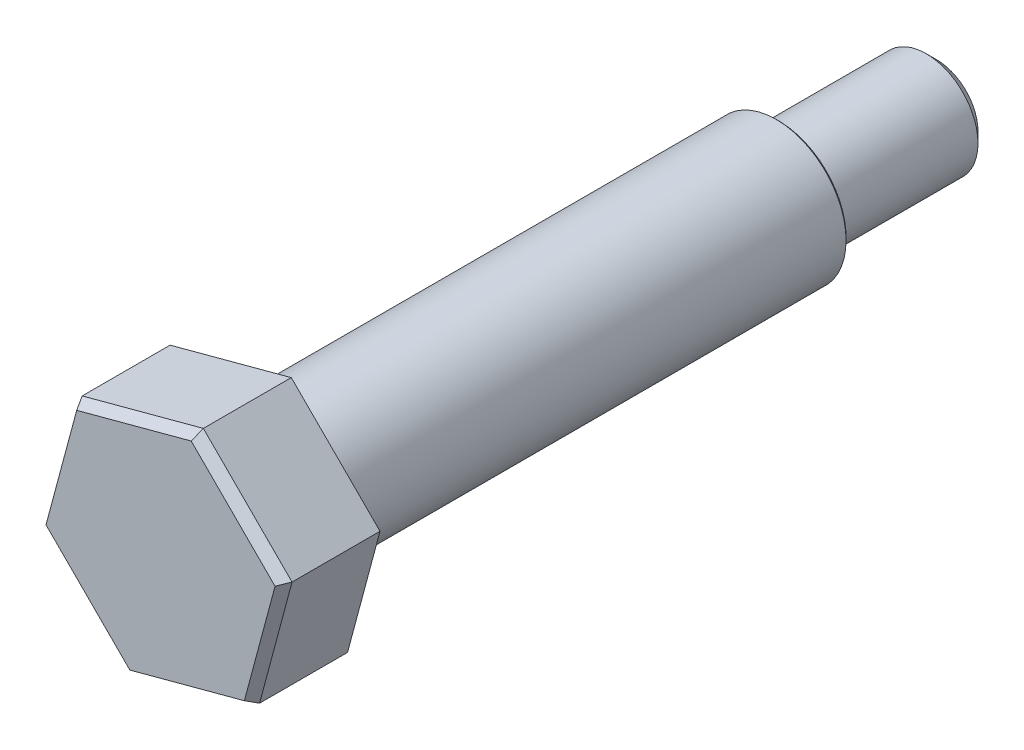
ISO-10303-21;
HEADER;
FILE_DESCRIPTION(('STEP AP214'),'2;1');
FILE_NAME('part.step','',(''),(''),'','','');
FILE_SCHEMA(('AUTOMOTIVE_DESIGN { 1 0 10303 214 1 1 1 1 }'));
ENDSEC;
DATA;
#1=APPLICATION_CONTEXT('core data for automotive mechanical design processes');
#2=APPLICATION_PROTOCOL_DEFINITION('international standard','automotive_design',2000,#1);
#3=PRODUCT_CONTEXT('',#1,'mechanical');
#4=PRODUCT('Part','Part','',(#3));
#5=PRODUCT_RELATED_PRODUCT_CATEGORY('part','',(#4));
#6=PRODUCT_DEFINITION_FORMATION('','',#4);
#7=PRODUCT_DEFINITION_CONTEXT('part definition',#1,'design');
#8=PRODUCT_DEFINITION('design','',#6,#7);
#9=PRODUCT_DEFINITION_SHAPE('','',#8);
#10=(LENGTH_UNIT() NAMED_UNIT(*) SI_UNIT(.MILLI.,.METRE.));
#11=(NAMED_UNIT(*) PLANE_ANGLE_UNIT() SI_UNIT($,.RADIAN.));
#12=(NAMED_UNIT(*) SI_UNIT($,.STERADIAN.) SOLID_ANGLE_UNIT());
#13=UNCERTAINTY_MEASURE_WITH_UNIT(LENGTH_MEASURE(1.E-05),#10,'distance_accuracy_value','');
#14=(GEOMETRIC_REPRESENTATION_CONTEXT(3) GLOBAL_UNCERTAINTY_ASSIGNED_CONTEXT((#13)) GLOBAL_UNIT_ASSIGNED_CONTEXT((#10,
#11,#12)) REPRESENTATION_CONTEXT('',''));
#15=CARTESIAN_POINT('',(0.,0.,0.));
#16=DIRECTION('',(0.,0.,1.));
#17=DIRECTION('',(1.,0.,0.));
#18=AXIS2_PLACEMENT_3D('',#15,#16,#17);
#19=CARTESIAN_POINT('',(0.,0.,-98.5));
#20=DIRECTION('',(0.,0.,-1.));
#21=DIRECTION('',(-1.,0.,0.));
#22=AXIS2_PLACEMENT_3D('',#19,#20,#21);
#23=PLANE('',#22);
#24=CARTESIAN_POINT('',(0.,0.,-98.5));
#25=DIRECTION('',(0.,0.,-1.));
#26=DIRECTION('',(-1.,0.,0.));
#27=AXIS2_PLACEMENT_3D('',#24,#25,#26);
#28=CIRCLE('',#27,10.5);
#29=CARTESIAN_POINT('',(-10.5,0.,-98.5));
#30=VERTEX_POINT('',#29);
#31=EDGE_CURVE('E188',#30,#30,#28,.F.);
#32=ORIENTED_EDGE('',*,*,#31,.T.);
#33=EDGE_LOOP('',(#32));
#34=FACE_BOUND('',#33,.T.);
#35=CARTESIAN_POINT('',(0.,0.,-98.5));
#36=DIRECTION('',(0.,0.,-1.));
#37=DIRECTION('',(-1.,0.,0.));
#38=AXIS2_PLACEMENT_3D('',#35,#36,#37);
#39=CIRCLE('',#38,13.);
#40=CARTESIAN_POINT('',(-13.,0.,-98.5));
#41=VERTEX_POINT('',#40);
#42=EDGE_CURVE('E155',#41,#41,#39,.T.);
#43=ORIENTED_EDGE('',*,*,#42,.T.);
#44=EDGE_LOOP('',(#43));
#45=FACE_BOUND('',#44,.T.);
#46=ADVANCED_FACE('F32',(#34,#45),#23,.T.);
#47=CARTESIAN_POINT('',(0.,0.,2.));
#48=DIRECTION('',(0.,0.,-1.));
#49=DIRECTION('',(-1.,0.,0.));
#50=AXIS2_PLACEMENT_3D('',#47,#48,#49);
#51=CYLINDRICAL_SURFACE('',#50,13.4);
#52=CARTESIAN_POINT('',(0.,0.,1.5));
#53=DIRECTION('',(0.,0.,-1.));
#54=DIRECTION('',(-1.,0.,0.));
#55=AXIS2_PLACEMENT_3D('',#52,#53,#54);
#56=CIRCLE('',#55,13.4);
#57=CARTESIAN_POINT('',(-13.4,0.,1.5));
#58=VERTEX_POINT('',#57);
#59=EDGE_CURVE('E40',#58,#58,#56,.T.);
#60=ORIENTED_EDGE('',*,*,#59,.T.);
#61=EDGE_LOOP('',(#60));
#62=FACE_BOUND('',#61,.T.);
#63=CARTESIAN_POINT('',(0.,0.,0.));
#64=DIRECTION('',(0.,0.,-1.));
#65=DIRECTION('',(-1.,0.,0.));
#66=AXIS2_PLACEMENT_3D('',#63,#64,#65);
#67=CIRCLE('',#66,13.4);
#68=CARTESIAN_POINT('',(-13.4,0.,0.));
#69=VERTEX_POINT('',#68);
#70=EDGE_CURVE('E126',#69,#69,#67,.T.);
#71=ORIENTED_EDGE('',*,*,#70,.F.);
#72=EDGE_LOOP('',(#71));
#73=FACE_BOUND('',#72,.T.);
#74=ADVANCED_FACE('F34',(#62,#73),#51,.T.);
#75=CARTESIAN_POINT('',(-6.27602830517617,-23.4224565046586,2.));
#76=DIRECTION('',(0.,0.,-1.));
#77=DIRECTION('',(-1.,0.,0.));
#78=AXIS2_PLACEMENT_3D('',#75,#76,#77);
#79=PLANE('',#78);
#80=CARTESIAN_POINT('',(0.,0.,2.));
#81=DIRECTION('',(0.,0.,-1.));
#82=DIRECTION('',(-1.,0.,0.));
#83=AXIS2_PLACEMENT_3D('',#80,#81,#82);
#84=CIRCLE('',#83,13.9);
#85=CARTESIAN_POINT('',(-13.9,0.,2.));
#86=VERTEX_POINT('',#85);
#87=EDGE_CURVE('E191',#86,#86,#84,.F.);
#88=ORIENTED_EDGE('',*,*,#87,.T.);
#89=EDGE_LOOP('',(#88));
#90=FACE_BOUND('',#89,.T.);
#91=DIRECTION('',(0.965925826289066,0.258819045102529,0.));
#92=VECTOR('',#91,1.);
#93=CARTESIAN_POINT('',(-6.27602830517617,-23.4224565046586,2.));
#94=LINE('',#93,#92);
#95=CARTESIAN_POINT('',(-6.27602830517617,-23.4224565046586,2.));
#96=VERTEX_POINT('',#95);
#97=CARTESIAN_POINT('',(17.1464281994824,-17.1464281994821,2.));
#98=VERTEX_POINT('',#97);
#99=EDGE_CURVE('E117',#96,#98,#94,.T.);
#100=ORIENTED_EDGE('',*,*,#99,.F.);
#101=DIRECTION('',(0.707106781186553,-0.707106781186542,0.));
#102=VECTOR('',#101,1.);
#103=CARTESIAN_POINT('',(-23.4224565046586,-6.27602830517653,2.));
#104=LINE('',#103,#102);
#105=CARTESIAN_POINT('',(-23.4224565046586,-6.27602830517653,2.));
#106=VERTEX_POINT('',#105);
#107=EDGE_CURVE('E140',#106,#96,#104,.T.);
#108=ORIENTED_EDGE('',*,*,#107,.F.);
#109=DIRECTION('',(-0.258819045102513,-0.965925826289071,0.));
#110=VECTOR('',#109,1.);
#111=CARTESIAN_POINT('',(-17.1464281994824,17.1464281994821,2.));
#112=LINE('',#111,#110);
#113=CARTESIAN_POINT('',(-17.1464281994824,17.1464281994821,2.));
#114=VERTEX_POINT('',#113);
#115=EDGE_CURVE('E137',#114,#106,#112,.T.);
#116=ORIENTED_EDGE('',*,*,#115,.F.);
#117=DIRECTION('',(-0.965925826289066,-0.258819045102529,0.));
#118=VECTOR('',#117,1.);
#119=CARTESIAN_POINT('',(6.27602830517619,23.4224565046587,2.));
#120=LINE('',#119,#118);
#121=CARTESIAN_POINT('',(6.27602830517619,23.4224565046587,2.));
#122=VERTEX_POINT('',#121);
#123=EDGE_CURVE('E134',#122,#114,#120,.T.);
#124=ORIENTED_EDGE('',*,*,#123,.F.);
#125=DIRECTION('',(-0.707106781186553,0.707106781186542,0.));
#126=VECTOR('',#125,1.);
#127=CARTESIAN_POINT('',(23.4224565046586,6.27602830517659,2.));
#128=LINE('',#127,#126);
#129=CARTESIAN_POINT('',(23.4224565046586,6.27602830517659,2.));
#130=VERTEX_POINT('',#129);
#131=EDGE_CURVE('E120',#130,#122,#128,.T.);
#132=ORIENTED_EDGE('',*,*,#131,.F.);
#133=DIRECTION('',(0.258819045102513,0.96592582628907,0.));
#134=VECTOR('',#133,1.);
#135=CARTESIAN_POINT('',(17.1464281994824,-17.1464281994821,2.));
#136=LINE('',#135,#134);
#137=EDGE_CURVE('E105',#98,#130,#136,.T.);
#138=ORIENTED_EDGE('',*,*,#137,.F.);
#139=EDGE_LOOP('',(#100,#108,#116,#124,#132,#138));
#140=FACE_BOUND('',#139,.T.);
#141=ADVANCED_FACE('F115',(#90,#140),#79,.T.);
#142=CARTESIAN_POINT('',(-6.27602830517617,-23.4224565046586,21.));
#143=DIRECTION('',(-0.258819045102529,0.965925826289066,0.));
#144=DIRECTION('',(-0.965925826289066,-0.258819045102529,0.));
#145=AXIS2_PLACEMENT_3D('',#142,#143,#144);
#146=PLANE('',#145);
#147=DIRECTION('',(0.,0.,-1.));
#148=VECTOR('',#147,1.);
#149=CARTESIAN_POINT('',(17.1464281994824,-17.1464281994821,21.));
#150=LINE('',#149,#148);
#151=CARTESIAN_POINT('',(17.1464281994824,-17.1464281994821,19.));
#152=VERTEX_POINT('',#151);
#153=EDGE_CURVE('E102',#152,#98,#150,.T.);
#154=ORIENTED_EDGE('',*,*,#153,.F.);
#155=DIRECTION('',(-0.965925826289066,-0.258819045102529,0.));
#156=VECTOR('',#155,1.);
#157=CARTESIAN_POINT('',(-6.27602830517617,-23.4224565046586,19.));
#158=LINE('',#157,#156);
#159=CARTESIAN_POINT('',(-6.27602830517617,-23.4224565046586,19.));
#160=VERTEX_POINT('',#159);
#161=EDGE_CURVE('E183',#152,#160,#158,.T.);
#162=ORIENTED_EDGE('',*,*,#161,.T.);
#163=DIRECTION('',(0.,0.,-1.));
#164=VECTOR('',#163,1.);
#165=CARTESIAN_POINT('',(-6.27602830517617,-23.4224565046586,21.));
#166=LINE('',#165,#164);
#167=EDGE_CURVE('E124',#160,#96,#166,.T.);
#168=ORIENTED_EDGE('',*,*,#167,.T.);
#169=ORIENTED_EDGE('',*,*,#99,.T.);
#170=EDGE_LOOP('',(#154,#162,#168,#169));
#171=FACE_BOUND('',#170,.T.);
#172=ADVANCED_FACE('F122',(#171),#146,.F.);
#173=CARTESIAN_POINT('',(17.1464281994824,-17.1464281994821,21.));
#174=DIRECTION('',(-0.96592582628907,0.258819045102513,0.));
#175=DIRECTION('',(-0.258819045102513,-0.965925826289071,0.));
#176=AXIS2_PLACEMENT_3D('',#173,#174,#175);
#177=PLANE('',#176);
#178=DIRECTION('',(0.,0.,-1.));
#179=VECTOR('',#178,1.);
#180=CARTESIAN_POINT('',(23.4224565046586,6.27602830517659,21.));
#181=LINE('',#180,#179);
#182=CARTESIAN_POINT('',(23.4224565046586,6.27602830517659,19.));
#183=VERTEX_POINT('',#182);
#184=EDGE_CURVE('E111',#183,#130,#181,.T.);
#185=ORIENTED_EDGE('',*,*,#184,.F.);
#186=DIRECTION('',(-0.258819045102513,-0.965925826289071,0.));
#187=VECTOR('',#186,1.);
#188=CARTESIAN_POINT('',(17.1464281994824,-17.1464281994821,19.));
#189=LINE('',#188,#187);
#190=EDGE_CURVE('E47',#183,#152,#189,.T.);
#191=ORIENTED_EDGE('',*,*,#190,.T.);
#192=ORIENTED_EDGE('',*,*,#153,.T.);
#193=ORIENTED_EDGE('',*,*,#137,.T.);
#194=EDGE_LOOP('',(#185,#191,#192,#193));
#195=FACE_BOUND('',#194,.T.);
#196=ADVANCED_FACE('F104',(#195),#177,.F.);
#197=CARTESIAN_POINT('',(23.4224565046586,6.27602830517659,21.));
#198=DIRECTION('',(-0.707106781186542,-0.707106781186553,0.));
#199=DIRECTION('',(0.707106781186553,-0.707106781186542,0.));
#200=AXIS2_PLACEMENT_3D('',#197,#198,#199);
#201=PLANE('',#200);
#202=DIRECTION('',(0.,0.,-1.));
#203=VECTOR('',#202,1.);
#204=CARTESIAN_POINT('',(6.27602830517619,23.4224565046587,21.));
#205=LINE('',#204,#203);
#206=CARTESIAN_POINT('',(6.27602830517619,23.4224565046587,19.));
#207=VERTEX_POINT('',#206);
#208=EDGE_CURVE('E147',#207,#122,#205,.T.);
#209=ORIENTED_EDGE('',*,*,#208,.F.);
#210=DIRECTION('',(0.707106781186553,-0.707106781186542,0.));
#211=VECTOR('',#210,1.);
#212=CARTESIAN_POINT('',(23.4224565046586,6.27602830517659,19.));
#213=LINE('',#212,#211);
#214=EDGE_CURVE('E55',#207,#183,#213,.T.);
#215=ORIENTED_EDGE('',*,*,#214,.T.);
#216=ORIENTED_EDGE('',*,*,#184,.T.);
#217=ORIENTED_EDGE('',*,*,#131,.T.);
#218=EDGE_LOOP('',(#209,#215,#216,#217));
#219=FACE_BOUND('',#218,.T.);
#220=ADVANCED_FACE('F385',(#219),#201,.F.);
#221=CARTESIAN_POINT('',(6.27602830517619,23.4224565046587,21.));
#222=DIRECTION('',(0.258819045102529,-0.965925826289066,0.));
#223=DIRECTION('',(0.965925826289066,0.258819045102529,0.));
#224=AXIS2_PLACEMENT_3D('',#221,#222,#223);
#225=PLANE('',#224);
#226=DIRECTION('',(0.,0.,-1.));
#227=VECTOR('',#226,1.);
#228=CARTESIAN_POINT('',(-17.1464281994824,17.1464281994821,21.));
#229=LINE('',#228,#227);
#230=CARTESIAN_POINT('',(-17.1464281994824,17.1464281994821,19.));
#231=VERTEX_POINT('',#230);
#232=EDGE_CURVE('E145',#231,#114,#229,.T.);
#233=ORIENTED_EDGE('',*,*,#232,.F.);
#234=DIRECTION('',(0.965925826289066,0.258819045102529,0.));
#235=VECTOR('',#234,1.);
#236=CARTESIAN_POINT('',(6.27602830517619,23.4224565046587,19.));
#237=LINE('',#236,#235);
#238=EDGE_CURVE('E179',#231,#207,#237,.T.);
#239=ORIENTED_EDGE('',*,*,#238,.T.);
#240=ORIENTED_EDGE('',*,*,#208,.T.);
#241=ORIENTED_EDGE('',*,*,#123,.T.);
#242=EDGE_LOOP('',(#233,#239,#240,#241));
#243=FACE_BOUND('',#242,.T.);
#244=ADVANCED_FACE('F383',(#243),#225,.F.);
#245=CARTESIAN_POINT('',(-17.1464281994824,17.1464281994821,21.));
#246=DIRECTION('',(0.96592582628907,-0.258819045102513,0.));
#247=DIRECTION('',(0.258819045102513,0.96592582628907,0.));
#248=AXIS2_PLACEMENT_3D('',#245,#246,#247);
#249=PLANE('',#248);
#250=DIRECTION('',(0.,0.,-1.));
#251=VECTOR('',#250,1.);
#252=CARTESIAN_POINT('',(-23.4224565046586,-6.27602830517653,21.));
#253=LINE('',#252,#251);
#254=CARTESIAN_POINT('',(-23.4224565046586,-6.27602830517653,19.));
#255=VERTEX_POINT('',#254);
#256=EDGE_CURVE('E143',#255,#106,#253,.T.);
#257=ORIENTED_EDGE('',*,*,#256,.F.);
#258=DIRECTION('',(0.258819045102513,0.96592582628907,0.));
#259=VECTOR('',#258,1.);
#260=CARTESIAN_POINT('',(-17.1464281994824,17.1464281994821,19.));
#261=LINE('',#260,#259);
#262=EDGE_CURVE('E177',#255,#231,#261,.T.);
#263=ORIENTED_EDGE('',*,*,#262,.T.);
#264=ORIENTED_EDGE('',*,*,#232,.T.);
#265=ORIENTED_EDGE('',*,*,#115,.T.);
#266=EDGE_LOOP('',(#257,#263,#264,#265));
#267=FACE_BOUND('',#266,.T.);
#268=ADVANCED_FACE('F380',(#267),#249,.F.);
#269=CARTESIAN_POINT('',(-23.4224565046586,-6.27602830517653,21.));
#270=DIRECTION('',(0.707106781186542,0.707106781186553,0.));
#271=DIRECTION('',(-0.707106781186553,0.707106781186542,0.));
#272=AXIS2_PLACEMENT_3D('',#269,#270,#271);
#273=PLANE('',#272);
#274=ORIENTED_EDGE('',*,*,#167,.F.);
#275=DIRECTION('',(-0.707106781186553,0.707106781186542,0.));
#276=VECTOR('',#275,1.);
#277=CARTESIAN_POINT('',(-23.4224565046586,-6.27602830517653,19.));
#278=LINE('',#277,#276);
#279=EDGE_CURVE('E174',#160,#255,#278,.T.);
#280=ORIENTED_EDGE('',*,*,#279,.T.);
#281=ORIENTED_EDGE('',*,*,#256,.T.);
#282=ORIENTED_EDGE('',*,*,#107,.T.);
#283=EDGE_LOOP('',(#274,#280,#281,#282));
#284=FACE_BOUND('',#283,.T.);
#285=ADVANCED_FACE('F233',(#284),#273,.F.);
#286=CARTESIAN_POINT('',(-6.27602830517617,-23.4224565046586,21.));
#287=DIRECTION('',(0.,0.,-1.));
#288=DIRECTION('',(-1.,0.,0.));
#289=AXIS2_PLACEMENT_3D('',#286,#287,#288);
#290=PLANE('',#289);
#291=DIRECTION('',(-0.258819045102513,-0.96592582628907,0.));
#292=VECTOR('',#291,1.);
#293=CARTESIAN_POINT('',(-25.4451155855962,-18.2861150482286,21.));
#294=LINE('',#293,#292);
#295=CARTESIAN_POINT('',(-16.2036191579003,16.2036191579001,21.));
#296=VERTEX_POINT('',#295);
#297=CARTESIAN_POINT('',(-22.1345554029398,-5.93093624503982,21.));
#298=VERTEX_POINT('',#297);
#299=EDGE_CURVE('E169',#296,#298,#294,.T.);
#300=ORIENTED_EDGE('',*,*,#299,.T.);
#301=DIRECTION('',(0.707106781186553,-0.707106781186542,0.));
#302=VECTOR('',#301,1.);
#303=CARTESIAN_POINT('',(-5.45953172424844,-22.6059599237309,21.));
#304=LINE('',#303,#302);
#305=CARTESIAN_POINT('',(-5.93093624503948,-22.1345554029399,21.));
#306=VERTEX_POINT('',#305);
#307=EDGE_CURVE('E171',#298,#306,#304,.T.);
#308=ORIENTED_EDGE('',*,*,#307,.T.);
#309=DIRECTION('',(0.965925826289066,0.258819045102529,0.));
#310=VECTOR('',#309,1.);
#311=CARTESIAN_POINT('',(-6.57488679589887,-22.3071014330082,21.));
#312=LINE('',#311,#310);
#313=CARTESIAN_POINT('',(16.2036191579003,-16.2036191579,21.));
#314=VERTEX_POINT('',#313);
#315=EDGE_CURVE('E161',#306,#314,#312,.T.);
#316=ORIENTED_EDGE('',*,*,#315,.T.);
#317=DIRECTION('',(0.258819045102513,0.965925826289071,0.));
#318=VECTOR('',#317,1.);
#319=CARTESIAN_POINT('',(12.8930589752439,-28.5587979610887,21.));
#320=LINE('',#319,#318);
#321=CARTESIAN_POINT('',(22.1345554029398,5.93093624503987,21.));
#322=VERTEX_POINT('',#321);
#323=EDGE_CURVE('E163',#314,#322,#320,.T.);
#324=ORIENTED_EDGE('',*,*,#323,.T.);
#325=DIRECTION('',(-0.707106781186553,0.707106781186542,0.));
#326=VECTOR('',#325,1.);
#327=CARTESIAN_POINT('',(22.6059599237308,5.45953172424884,21.));
#328=LINE('',#327,#326);
#329=CARTESIAN_POINT('',(5.93093624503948,22.1345554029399,21.));
#330=VERTEX_POINT('',#329);
#331=EDGE_CURVE('E165',#322,#330,#328,.T.);
#332=ORIENTED_EDGE('',*,*,#331,.T.);
#333=DIRECTION('',(-0.965925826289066,-0.258819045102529,0.));
#334=VECTOR('',#333,1.);
#335=CARTESIAN_POINT('',(-16.8475697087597,16.0310731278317,21.));
#336=LINE('',#335,#334);
#337=EDGE_CURVE('E167',#330,#296,#336,.T.);
#338=ORIENTED_EDGE('',*,*,#337,.T.);
#339=EDGE_LOOP('',(#300,#308,#316,#324,#332,#338));
#340=FACE_BOUND('',#339,.T.);
#341=ADVANCED_FACE('F225',(#340),#290,.F.);
#342=CARTESIAN_POINT('',(0.,0.,-98.5));
#343=DIRECTION('',(0.,0.,1.));
#344=DIRECTION('',(1.,0.,0.));
#345=AXIS2_PLACEMENT_3D('',#342,#343,#344);
#346=CYLINDRICAL_SURFACE('',#345,13.5);
#347=CARTESIAN_POINT('',(0.,0.,-0.299999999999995));
#348=DIRECTION('',(0.,0.,1.));
#349=DIRECTION('',(1.,0.,0.));
#350=AXIS2_PLACEMENT_3D('',#347,#348,#349);
#351=CIRCLE('',#350,13.5);
#352=CARTESIAN_POINT('',(13.5,0.,-0.299999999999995));
#353=VERTEX_POINT('',#352);
#354=EDGE_CURVE('E11',#353,#353,#351,.F.);
#355=ORIENTED_EDGE('',*,*,#354,.T.);
#356=EDGE_LOOP('',(#355));
#357=FACE_BOUND('',#356,.T.);
#358=CARTESIAN_POINT('',(0.,0.,-98.));
#359=DIRECTION('',(0.,0.,-1.));
#360=DIRECTION('',(-1.,0.,0.));
#361=AXIS2_PLACEMENT_3D('',#358,#359,#360);
#362=CIRCLE('',#361,13.5);
#363=CARTESIAN_POINT('',(-13.5,0.,-98.));
#364=VERTEX_POINT('',#363);
#365=EDGE_CURVE('E158',#364,#364,#362,.F.);
#366=ORIENTED_EDGE('',*,*,#365,.T.);
#367=EDGE_LOOP('',(#366));
#368=FACE_BOUND('',#367,.T.);
#369=ADVANCED_FACE('F223',(#357,#368),#346,.T.);
#370=CARTESIAN_POINT('',(0.,0.,-129.));
#371=DIRECTION('',(0.,0.,1.));
#372=DIRECTION('',(1.,0.,0.));
#373=AXIS2_PLACEMENT_3D('',#370,#371,#372);
#374=CYLINDRICAL_SURFACE('',#373,10.);
#375=CARTESIAN_POINT('',(0.,0.,-99.));
#376=DIRECTION('',(0.,0.,-1.));
#377=DIRECTION('',(-1.,0.,0.));
#378=AXIS2_PLACEMENT_3D('',#375,#376,#377);
#379=CIRCLE('',#378,10.);
#380=CARTESIAN_POINT('',(10.,0.,-99.));
#381=VERTEX_POINT('',#380);
#382=EDGE_CURVE('E185',#381,#381,#379,.T.);
#383=CARTESIAN_POINT('',(0.,0.,-127.));
#384=DIRECTION('',(0.,0.,-1.));
#385=DIRECTION('',(-1.,0.,0.));
#386=AXIS2_PLACEMENT_3D('',#383,#384,#385);
#387=CIRCLE('',#386,10.);
#388=CARTESIAN_POINT('',(10.,0.,-127.));
#389=VERTEX_POINT('',#388);
#390=EDGE_CURVE('E152',#389,#389,#387,.F.);
#391=CARTESIAN_POINT('',(10.,0.,-99.));
#392=CARTESIAN_POINT('',(10.,0.,-99.2916666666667));
#393=CARTESIAN_POINT('',(10.,0.,-99.5833333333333));
#394=CARTESIAN_POINT('',(10.,0.,-100.166666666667));
#395=CARTESIAN_POINT('',(10.,0.,-100.458333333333));
#396=CARTESIAN_POINT('',(10.,0.,-101.041666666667));
#397=CARTESIAN_POINT('',(10.,0.,-101.333333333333));
#398=CARTESIAN_POINT('',(10.,0.,-101.916666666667));
#399=CARTESIAN_POINT('',(10.,0.,-102.208333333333));
#400=CARTESIAN_POINT('',(10.,0.,-102.791666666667));
#401=CARTESIAN_POINT('',(10.,0.,-103.083333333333));
#402=CARTESIAN_POINT('',(10.,0.,-103.666666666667));
#403=CARTESIAN_POINT('',(10.,0.,-103.958333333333));
#404=CARTESIAN_POINT('',(10.,0.,-104.541666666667));
#405=CARTESIAN_POINT('',(10.,0.,-104.833333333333));
#406=CARTESIAN_POINT('',(10.,0.,-105.416666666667));
#407=CARTESIAN_POINT('',(10.,0.,-105.708333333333));
#408=CARTESIAN_POINT('',(10.,0.,-106.291666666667));
#409=CARTESIAN_POINT('',(10.,0.,-106.583333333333));
#410=CARTESIAN_POINT('',(10.,0.,-107.166666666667));
#411=CARTESIAN_POINT('',(10.,0.,-107.458333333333));
#412=CARTESIAN_POINT('',(10.,0.,-108.041666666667));
#413=CARTESIAN_POINT('',(10.,0.,-108.333333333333));
#414=CARTESIAN_POINT('',(10.,0.,-108.916666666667));
#415=CARTESIAN_POINT('',(10.,0.,-109.208333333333));
#416=CARTESIAN_POINT('',(10.,0.,-109.791666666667));
#417=CARTESIAN_POINT('',(10.,0.,-110.083333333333));
#418=CARTESIAN_POINT('',(10.,0.,-110.666666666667));
#419=CARTESIAN_POINT('',(10.,0.,-110.958333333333));
#420=CARTESIAN_POINT('',(10.,0.,-111.541666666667));
#421=CARTESIAN_POINT('',(10.,0.,-111.833333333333));
#422=CARTESIAN_POINT('',(10.,0.,-112.416666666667));
#423=CARTESIAN_POINT('',(10.,0.,-112.708333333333));
#424=CARTESIAN_POINT('',(10.,0.,-113.291666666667));
#425=CARTESIAN_POINT('',(10.,0.,-113.583333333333));
#426=CARTESIAN_POINT('',(10.,0.,-114.166666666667));
#427=CARTESIAN_POINT('',(10.,0.,-114.458333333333));
#428=CARTESIAN_POINT('',(10.,0.,-115.041666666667));
#429=CARTESIAN_POINT('',(10.,0.,-115.333333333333));
#430=CARTESIAN_POINT('',(10.,0.,-115.916666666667));
#431=CARTESIAN_POINT('',(10.,0.,-116.208333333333));
#432=CARTESIAN_POINT('',(10.,0.,-116.791666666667));
#433=CARTESIAN_POINT('',(10.,0.,-117.083333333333));
#434=CARTESIAN_POINT('',(10.,0.,-117.666666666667));
#435=CARTESIAN_POINT('',(10.,0.,-117.958333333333));
#436=CARTESIAN_POINT('',(10.,0.,-118.541666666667));
#437=CARTESIAN_POINT('',(10.,0.,-118.833333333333));
#438=CARTESIAN_POINT('',(10.,0.,-119.416666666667));
#439=CARTESIAN_POINT('',(10.,0.,-119.708333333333));
#440=CARTESIAN_POINT('',(10.,0.,-120.291666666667));
#441=CARTESIAN_POINT('',(10.,0.,-120.583333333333));
#442=CARTESIAN_POINT('',(10.,0.,-121.166666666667));
#443=CARTESIAN_POINT('',(10.,0.,-121.458333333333));
#444=CARTESIAN_POINT('',(10.,0.,-122.041666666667));
#445=CARTESIAN_POINT('',(10.,0.,-122.333333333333));
#446=CARTESIAN_POINT('',(10.,0.,-122.916666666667));
#447=CARTESIAN_POINT('',(10.,0.,-123.208333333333));
#448=CARTESIAN_POINT('',(10.,0.,-123.791666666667));
#449=CARTESIAN_POINT('',(10.,0.,-124.083333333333));
#450=CARTESIAN_POINT('',(10.,0.,-124.666666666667));
#451=CARTESIAN_POINT('',(10.,0.,-124.958333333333));
#452=CARTESIAN_POINT('',(10.,0.,-125.541666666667));
#453=CARTESIAN_POINT('',(10.,0.,-125.833333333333));
#454=CARTESIAN_POINT('',(10.,0.,-126.416666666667));
#455=CARTESIAN_POINT('',(10.,0.,-126.708333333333));
#456=CARTESIAN_POINT('',(10.,0.,-127.));
#457=B_SPLINE_CURVE_WITH_KNOTS('',3,(#391,#392,#393,#394,#395,#396,#397,#398,#399,#400,#401,
#402,#403,#404,#405,#406,#407,#408,#409,#410,#411,#412,#413,#414,#415,#416,#417,#418,#419,#420,
#421,#422,#423,#424,#425,#426,#427,#428,#429,#430,#431,#432,#433,#434,#435,#436,#437,#438,#439,
#440,#441,#442,#443,#444,#445,#446,#447,#448,#449,#450,#451,#452,#453,#454,#455,#456),
.UNSPECIFIED.,.F.,.F.,(4,2,2,2,2,2,2,2,2,2,2,2,2,2,2,2,2,2,2,2,2,2,2,2,2,2,2,2,2,2,2,2,4),(0.,
0.875000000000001,1.75,2.625,3.5,4.375,5.25,6.12500000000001,7.00000000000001,7.87500000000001,
8.75000000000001,9.62500000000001,10.5,11.375,12.25,13.125,14.,14.875,15.75,16.625,17.5,18.375,
19.25,20.125,21.,21.875,22.75,23.625,24.5,25.375,26.25,27.125,28.),.UNSPECIFIED.);
#458=EDGE_CURVE('BSEAM221',#381,#389,#457,.T.);
#459=ORIENTED_EDGE('',*,*,#382,.T.);
#460=ORIENTED_EDGE('',*,*,#390,.T.);
#461=ORIENTED_EDGE('',*,*,#458,.T.);
#462=ORIENTED_EDGE('',*,*,#458,.F.);
#463=EDGE_LOOP('',(#459,#461,#460,#462));
#464=FACE_BOUND('',#463,.T.);
#465=ADVANCED_FACE('F221',(#464),#374,.T.);
#466=CARTESIAN_POINT('',(0.,0.,-129.));
#467=DIRECTION('',(0.,0.,-1.));
#468=DIRECTION('',(-1.,0.,0.));
#469=AXIS2_PLACEMENT_3D('',#466,#467,#468);
#470=PLANE('',#469);
#471=CARTESIAN_POINT('',(0.,0.,-129.));
#472=DIRECTION('',(0.,0.,-1.));
#473=DIRECTION('',(-1.,0.,0.));
#474=AXIS2_PLACEMENT_3D('',#471,#472,#473);
#475=CIRCLE('',#474,7.99999999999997);
#476=CARTESIAN_POINT('',(-7.99999999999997,0.,-129.));
#477=VERTEX_POINT('',#476);
#478=EDGE_CURVE('E110',#477,#477,#475,.T.);
#479=ORIENTED_EDGE('',*,*,#478,.T.);
#480=EDGE_LOOP('',(#479));
#481=FACE_BOUND('',#480,.T.);
#482=ADVANCED_FACE('F231',(#481),#470,.T.);
#483=CARTESIAN_POINT('',(0.,0.,-129.));
#484=DIRECTION('',(0.,0.,1.));
#485=DIRECTION('',(1.,0.,0.));
#486=AXIS2_PLACEMENT_3D('',#483,#484,#485);
#487=CONICAL_SURFACE('',#486,7.99999999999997,0.785398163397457);
#488=ORIENTED_EDGE('',*,*,#390,.F.);
#489=EDGE_LOOP('',(#488));
#490=FACE_BOUND('',#489,.T.);
#491=ORIENTED_EDGE('',*,*,#478,.F.);
#492=EDGE_LOOP('',(#491));
#493=FACE_BOUND('',#492,.T.);
#494=ADVANCED_FACE('F243',(#490,#493),#487,.T.);
#495=CARTESIAN_POINT('',(0.,0.,-98.5));
#496=DIRECTION('',(0.,0.,1.));
#497=DIRECTION('',(1.,0.,0.));
#498=AXIS2_PLACEMENT_3D('',#495,#496,#497);
#499=CONICAL_SURFACE('',#498,13.,0.785398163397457);
#500=ORIENTED_EDGE('',*,*,#365,.F.);
#501=EDGE_LOOP('',(#500));
#502=FACE_BOUND('',#501,.T.);
#503=ORIENTED_EDGE('',*,*,#42,.F.);
#504=EDGE_LOOP('',(#503));
#505=FACE_BOUND('',#504,.T.);
#506=ADVANCED_FACE('F239',(#502,#505),#499,.T.);
#507=CARTESIAN_POINT('',(22.6059599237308,5.45953172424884,21.));
#508=DIRECTION('',(-0.612372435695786,-0.612372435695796,-0.500000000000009));
#509=DIRECTION('',(0.707106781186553,-0.707106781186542,0.));
#510=AXIS2_PLACEMENT_3D('',#507,#508,#509);
#511=PLANE('',#510);
#512=DIRECTION('',(-0.535799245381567,-0.143566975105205,0.832050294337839));
#513=VECTOR('',#512,1.);
#514=CARTESIAN_POINT('',(16.8284424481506,4.5091675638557,29.2399385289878));
#515=LINE('',#514,#513);
#516=EDGE_CURVE('E389',#183,#322,#515,.T.);
#517=ORIENTED_EDGE('',*,*,#516,.F.);
#518=ORIENTED_EDGE('',*,*,#214,.F.);
#519=DIRECTION('',(-0.143566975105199,-0.535799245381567,0.83205029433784));
#520=VECTOR('',#519,1.);
#521=CARTESIAN_POINT('',(4.99193897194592,18.6301698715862,26.4420103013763));
#522=LINE('',#521,#520);
#523=EDGE_CURVE('E129',#330,#207,#522,.F.);
#524=ORIENTED_EDGE('',*,*,#523,.F.);
#525=ORIENTED_EDGE('',*,*,#331,.F.);
#526=EDGE_LOOP('',(#517,#518,#524,#525));
#527=FACE_BOUND('',#526,.T.);
#528=ADVANCED_FACE('F242',(#527),#511,.F.);
#529=CARTESIAN_POINT('',(-16.8475697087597,16.0310731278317,21.));
#530=DIRECTION('',(0.22414386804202,-0.836516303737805,-0.500000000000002));
#531=DIRECTION('',(0.,0.513054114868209,-0.858356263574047));
#532=AXIS2_PLACEMENT_3D('',#529,#530,#531);
#533=PLANE('',#532);
#534=ORIENTED_EDGE('',*,*,#523,.T.);
#535=ORIENTED_EDGE('',*,*,#238,.F.);
#536=DIRECTION('',(0.392232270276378,-0.392232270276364,0.832050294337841));
#537=VECTOR('',#536,1.);
#538=CARTESIAN_POINT('',(-16.2761429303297,16.2761429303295,20.8461538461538));
#539=LINE('',#538,#537);
#540=EDGE_CURVE('E375',#296,#231,#539,.F.);
#541=ORIENTED_EDGE('',*,*,#540,.F.);
#542=ORIENTED_EDGE('',*,*,#337,.F.);
#543=EDGE_LOOP('',(#534,#535,#541,#542));
#544=FACE_BOUND('',#543,.T.);
#545=ADVANCED_FACE('F250',(#544),#533,.F.);
#546=CARTESIAN_POINT('',(12.8930589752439,-28.5587979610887,21.));
#547=DIRECTION('',(-0.836516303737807,0.224143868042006,-0.500000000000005));
#548=DIRECTION('',(-0.51305411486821,0.,0.858356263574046));
#549=AXIS2_PLACEMENT_3D('',#546,#547,#548);
#550=PLANE('',#549);
#551=ORIENTED_EDGE('',*,*,#516,.T.);
#552=ORIENTED_EDGE('',*,*,#323,.F.);
#553=DIRECTION('',(-0.392232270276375,0.392232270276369,0.83205029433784));
#554=VECTOR('',#553,1.);
#555=CARTESIAN_POINT('',(13.6382308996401,-13.6382308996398,26.4420103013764));
#556=LINE('',#555,#554);
#557=EDGE_CURVE('E370',#152,#314,#556,.T.);
#558=ORIENTED_EDGE('',*,*,#557,.F.);
#559=ORIENTED_EDGE('',*,*,#190,.F.);
#560=EDGE_LOOP('',(#551,#552,#558,#559));
#561=FACE_BOUND('',#560,.T.);
#562=ADVANCED_FACE('F287',(#561),#550,.F.);
#563=CARTESIAN_POINT('',(-25.4451155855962,-18.2861150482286,21.));
#564=DIRECTION('',(0.836516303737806,-0.224143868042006,-0.500000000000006));
#565=DIRECTION('',(-0.513054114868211,0.,-0.858356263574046));
#566=AXIS2_PLACEMENT_3D('',#563,#564,#565);
#567=PLANE('',#566);
#568=ORIENTED_EDGE('',*,*,#540,.T.);
#569=ORIENTED_EDGE('',*,*,#262,.F.);
#570=DIRECTION('',(0.535799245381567,0.143566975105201,0.83205029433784));
#571=VECTOR('',#570,1.);
#572=CARTESIAN_POINT('',(-24.0353521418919,-6.44025319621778,18.0482256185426));
#573=LINE('',#572,#571);
#574=EDGE_CURVE('E366',#298,#255,#573,.F.);
#575=ORIENTED_EDGE('',*,*,#574,.F.);
#576=ORIENTED_EDGE('',*,*,#299,.F.);
#577=EDGE_LOOP('',(#568,#569,#575,#576));
#578=FACE_BOUND('',#577,.T.);
#579=ADVANCED_FACE('F297',(#578),#567,.F.);
#580=CARTESIAN_POINT('',(-6.57488679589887,-22.3071014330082,21.));
#581=DIRECTION('',(-0.224143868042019,0.836516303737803,-0.500000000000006));
#582=DIRECTION('',(0.,0.513054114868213,0.858356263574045));
#583=AXIS2_PLACEMENT_3D('',#580,#581,#582);
#584=PLANE('',#583);
#585=ORIENTED_EDGE('',*,*,#557,.T.);
#586=ORIENTED_EDGE('',*,*,#315,.F.);
#587=DIRECTION('',(-0.143566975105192,-0.53579924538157,-0.83205029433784));
#588=VECTOR('',#587,1.);
#589=CARTESIAN_POINT('',(-5.95748178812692,-22.2336247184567,20.8461538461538));
#590=LINE('',#589,#588);
#591=EDGE_CURVE('E371',#160,#306,#590,.F.);
#592=ORIENTED_EDGE('',*,*,#591,.F.);
#593=ORIENTED_EDGE('',*,*,#161,.F.);
#594=EDGE_LOOP('',(#585,#586,#592,#593));
#595=FACE_BOUND('',#594,.T.);
#596=ADVANCED_FACE('F307',(#595),#584,.F.);
#597=CARTESIAN_POINT('',(-5.45953172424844,-22.6059599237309,21.));
#598=DIRECTION('',(0.612372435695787,0.612372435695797,-0.500000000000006));
#599=DIRECTION('',(-0.707106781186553,0.707106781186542,0.));
#600=AXIS2_PLACEMENT_3D('',#597,#598,#599);
#601=PLANE('',#600);
#602=ORIENTED_EDGE('',*,*,#574,.T.);
#603=ORIENTED_EDGE('',*,*,#279,.F.);
#604=ORIENTED_EDGE('',*,*,#591,.T.);
#605=ORIENTED_EDGE('',*,*,#307,.F.);
#606=EDGE_LOOP('',(#602,#603,#604,#605));
#607=FACE_BOUND('',#606,.T.);
#608=ADVANCED_FACE('F317',(#607),#601,.F.);
#609=CARTESIAN_POINT('',(0.,0.,-99.));
#610=DIRECTION('',(0.,0.,-1.));
#611=DIRECTION('',(-1.,0.,0.));
#612=AXIS2_PLACEMENT_3D('',#609,#610,#611);
#613=TOROIDAL_SURFACE('',#612,10.5,0.5);
#614=ORIENTED_EDGE('',*,*,#31,.F.);
#615=EDGE_LOOP('',(#614));
#616=FACE_BOUND('',#615,.T.);
#617=ORIENTED_EDGE('',*,*,#382,.F.);
#618=EDGE_LOOP('',(#617));
#619=FACE_BOUND('',#618,.T.);
#620=ADVANCED_FACE('F202',(#616,#619),#613,.F.);
#621=CARTESIAN_POINT('',(0.,0.,1.5));
#622=DIRECTION('',(0.,0.,-1.));
#623=DIRECTION('',(-1.,0.,0.));
#624=AXIS2_PLACEMENT_3D('',#621,#622,#623);
#625=TOROIDAL_SURFACE('',#624,13.9,0.5);
#626=ORIENTED_EDGE('',*,*,#59,.F.);
#627=EDGE_LOOP('',(#626));
#628=FACE_BOUND('',#627,.T.);
#629=ORIENTED_EDGE('',*,*,#87,.F.);
#630=EDGE_LOOP('',(#629));
#631=FACE_BOUND('',#630,.T.);
#632=ADVANCED_FACE('F198',(#628,#631),#625,.F.);
#633=CARTESIAN_POINT('',(0.,0.,-0.299999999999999));
#634=DIRECTION('',(0.,0.,1.));
#635=DIRECTION('',(1.,0.,0.));
#636=AXIS2_PLACEMENT_3D('',#633,#634,#635);
#637=TOROIDAL_SURFACE('',#636,13.,0.5);
#638=ORIENTED_EDGE('',*,*,#70,.T.);
#639=EDGE_LOOP('',(#638));
#640=FACE_BOUND('',#639,.T.);
#641=ORIENTED_EDGE('',*,*,#354,.F.);
#642=EDGE_LOOP('',(#641));
#643=FACE_BOUND('',#642,.T.);
#644=ADVANCED_FACE('F201',(#640,#643),#637,.T.);
#645=CLOSED_SHELL('',(#46,#74,#141,#172,#196,#220,#244,#268,#285,#341,#369,#465,#482,#494,#506,
#528,#545,#562,#579,#596,#608,#620,#632,#644));
#646=MANIFOLD_SOLID_BREP('B2',#645);
#647=ADVANCED_BREP_SHAPE_REPRESENTATION('',(#18,#646),#14);
#648=SHAPE_DEFINITION_REPRESENTATION(#9,#647);
ENDSEC;
END-ISO-10303-21;
